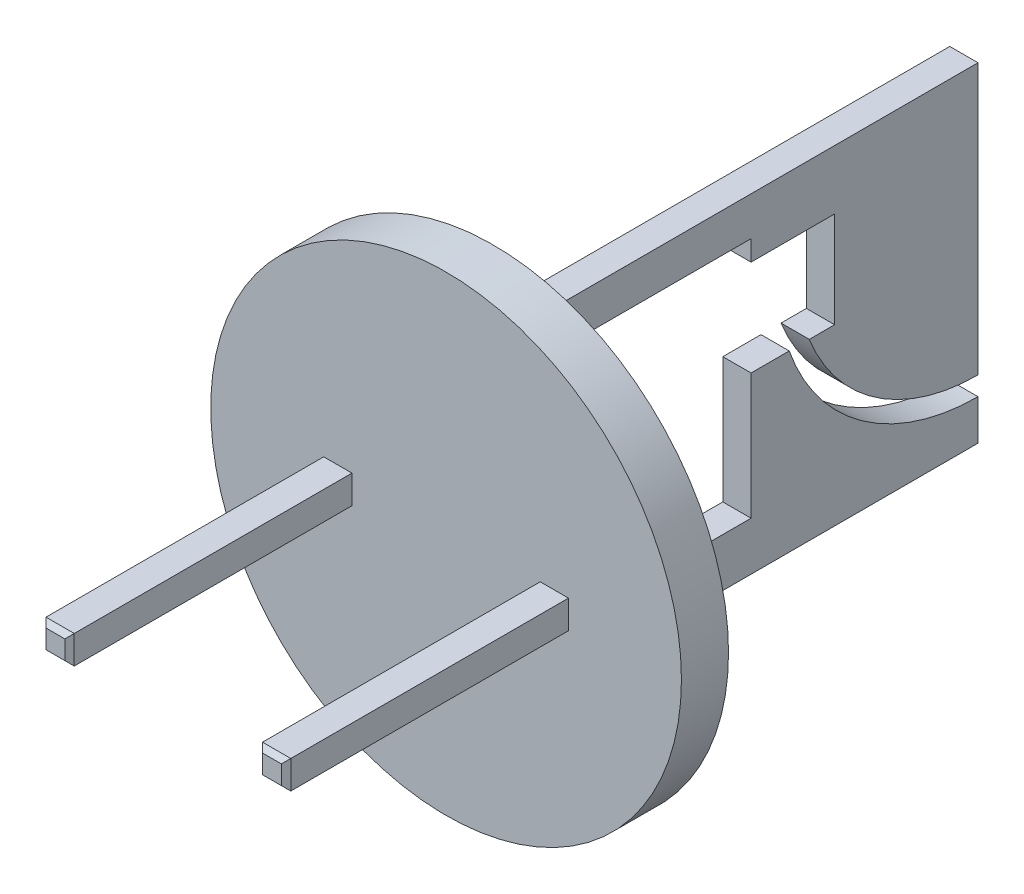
ISO-10303-21;
HEADER;
FILE_DESCRIPTION(('STEP AP214'),'2;1');
FILE_NAME('part.step','',(''),(''),'','','');
FILE_SCHEMA(('AUTOMOTIVE_DESIGN { 1 0 10303 214 1 1 1 1 }'));
ENDSEC;
DATA;
#1=APPLICATION_CONTEXT('core data for automotive mechanical design processes');
#2=APPLICATION_PROTOCOL_DEFINITION('international standard','automotive_design',2000,#1);
#3=PRODUCT_CONTEXT('',#1,'mechanical');
#4=PRODUCT('Part','Part','',(#3));
#5=PRODUCT_RELATED_PRODUCT_CATEGORY('part','',(#4));
#6=PRODUCT_DEFINITION_FORMATION('','',#4);
#7=PRODUCT_DEFINITION_CONTEXT('part definition',#1,'design');
#8=PRODUCT_DEFINITION('design','',#6,#7);
#9=PRODUCT_DEFINITION_SHAPE('','',#8);
#10=(LENGTH_UNIT() NAMED_UNIT(*) SI_UNIT(.MILLI.,.METRE.));
#11=(NAMED_UNIT(*) PLANE_ANGLE_UNIT() SI_UNIT($,.RADIAN.));
#12=(NAMED_UNIT(*) SI_UNIT($,.STERADIAN.) SOLID_ANGLE_UNIT());
#13=UNCERTAINTY_MEASURE_WITH_UNIT(LENGTH_MEASURE(1.E-05),#10,'distance_accuracy_value','');
#14=(GEOMETRIC_REPRESENTATION_CONTEXT(3) GLOBAL_UNCERTAINTY_ASSIGNED_CONTEXT((#13)) GLOBAL_UNIT_ASSIGNED_CONTEXT((#10,
#11,#12)) REPRESENTATION_CONTEXT('',''));
#15=CARTESIAN_POINT('',(0.,0.,0.));
#16=DIRECTION('',(0.,0.,1.));
#17=DIRECTION('',(1.,0.,0.));
#18=AXIS2_PLACEMENT_3D('',#15,#16,#17);
#19=CARTESIAN_POINT('',(0.,0.,0.));
#20=DIRECTION('',(0.,0.,1.));
#21=DIRECTION('',(1.,0.,0.));
#22=AXIS2_PLACEMENT_3D('',#19,#20,#21);
#23=PLANE('',#22);
#24=DIRECTION('',(1.,0.,0.));
#25=VECTOR('',#24,1.);
#26=CARTESIAN_POINT('',(-1.3,-0.15,0.));
#27=LINE('',#26,#25);
#28=CARTESIAN_POINT('',(-1.3,-0.15,0.));
#29=VERTEX_POINT('',#28);
#30=CARTESIAN_POINT('',(-1.,-0.15,0.));
#31=VERTEX_POINT('',#30);
#32=EDGE_CURVE('E253',#29,#31,#27,.T.);
#33=ORIENTED_EDGE('',*,*,#32,.F.);
#34=DIRECTION('',(0.,-1.,0.));
#35=VECTOR('',#34,1.);
#36=CARTESIAN_POINT('',(-1.3,0.15,0.));
#37=LINE('',#36,#35);
#38=CARTESIAN_POINT('',(-1.3,0.15,0.));
#39=VERTEX_POINT('',#38);
#40=EDGE_CURVE('E226',#39,#29,#37,.T.);
#41=ORIENTED_EDGE('',*,*,#40,.F.);
#42=DIRECTION('',(-1.,0.,0.));
#43=VECTOR('',#42,1.);
#44=CARTESIAN_POINT('',(-1.3,0.15,0.));
#45=LINE('',#44,#43);
#46=CARTESIAN_POINT('',(-1.,0.15,0.));
#47=VERTEX_POINT('',#46);
#48=EDGE_CURVE('E259',#47,#39,#45,.T.);
#49=ORIENTED_EDGE('',*,*,#48,.F.);
#50=DIRECTION('',(0.,1.,0.));
#51=VECTOR('',#50,1.);
#52=CARTESIAN_POINT('',(-1.,0.15,0.));
#53=LINE('',#52,#51);
#54=EDGE_CURVE('E256',#31,#47,#53,.T.);
#55=ORIENTED_EDGE('',*,*,#54,.F.);
#56=EDGE_LOOP('',(#33,#41,#49,#55));
#57=FACE_BOUND('',#56,.T.);
#58=CARTESIAN_POINT('',(0.,0.,0.));
#59=DIRECTION('',(0.,0.,1.));
#60=DIRECTION('',(1.,0.,0.));
#61=AXIS2_PLACEMENT_3D('',#58,#59,#60);
#62=CIRCLE('',#61,2.5);
#63=CARTESIAN_POINT('',(2.5,0.,0.));
#64=VERTEX_POINT('',#63);
#65=EDGE_CURVE('E363',#64,#64,#62,.T.);
#66=ORIENTED_EDGE('',*,*,#65,.T.);
#67=EDGE_LOOP('',(#66));
#68=FACE_BOUND('',#67,.T.);
#69=DIRECTION('',(0.,-1.,0.));
#70=VECTOR('',#69,1.);
#71=CARTESIAN_POINT('',(1.,0.15,0.));
#72=LINE('',#71,#70);
#73=CARTESIAN_POINT('',(1.,0.15,0.));
#74=VERTEX_POINT('',#73);
#75=CARTESIAN_POINT('',(1.,-0.15,0.));
#76=VERTEX_POINT('',#75);
#77=EDGE_CURVE('E220',#74,#76,#72,.T.);
#78=ORIENTED_EDGE('',*,*,#77,.F.);
#79=DIRECTION('',(-1.,0.,0.));
#80=VECTOR('',#79,1.);
#81=CARTESIAN_POINT('',(1.3,0.15,0.));
#82=LINE('',#81,#80);
#83=CARTESIAN_POINT('',(1.3,0.15,0.));
#84=VERTEX_POINT('',#83);
#85=EDGE_CURVE('E230',#84,#74,#82,.T.);
#86=ORIENTED_EDGE('',*,*,#85,.F.);
#87=DIRECTION('',(0.,1.,0.));
#88=VECTOR('',#87,1.);
#89=CARTESIAN_POINT('',(1.3,0.15,0.));
#90=LINE('',#89,#88);
#91=CARTESIAN_POINT('',(1.3,-0.15,0.));
#92=VERTEX_POINT('',#91);
#93=EDGE_CURVE('E242',#92,#84,#90,.T.);
#94=ORIENTED_EDGE('',*,*,#93,.F.);
#95=DIRECTION('',(1.,0.,0.));
#96=VECTOR('',#95,1.);
#97=CARTESIAN_POINT('',(1.3,-0.15,0.));
#98=LINE('',#97,#96);
#99=EDGE_CURVE('E240',#76,#92,#98,.T.);
#100=ORIENTED_EDGE('',*,*,#99,.F.);
#101=EDGE_LOOP('',(#78,#86,#94,#100));
#102=FACE_BOUND('',#101,.T.);
#103=ADVANCED_FACE('F31',(#57,#68,#102),#23,.T.);
#104=CARTESIAN_POINT('',(0.15,1.75,-5.5));
#105=DIRECTION('',(-1.,0.,0.));
#106=DIRECTION('',(0.,-1.,0.));
#107=AXIS2_PLACEMENT_3D('',#104,#105,#106);
#108=PLANE('',#107);
#109=DIRECTION('',(0.,-1.,0.));
#110=VECTOR('',#109,1.);
#111=CARTESIAN_POINT('',(0.15,1.75,-5.5));
#112=LINE('',#111,#110);
#113=CARTESIAN_POINT('',(0.15,-1.32192723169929,-5.5));
#114=VERTEX_POINT('',#113);
#115=CARTESIAN_POINT('',(0.15,-1.75,-5.5));
#116=VERTEX_POINT('',#115);
#117=EDGE_CURVE('E339',#114,#116,#112,.T.);
#118=ORIENTED_EDGE('',*,*,#117,.F.);
#119=CARTESIAN_POINT('',(0.15,0.802208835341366,-5.5));
#120=DIRECTION('',(1.,0.,0.));
#121=DIRECTION('',(0.,1.,0.));
#122=AXIS2_PLACEMENT_3D('',#119,#120,#121);
#123=CIRCLE('',#122,2.12413606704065);
#124=CARTESIAN_POINT('',(0.15,0.101539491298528,-3.49475275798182));
#125=VERTEX_POINT('',#124);
#126=EDGE_CURVE('E288',#125,#114,#123,.T.);
#127=ORIENTED_EDGE('',*,*,#126,.F.);
#128=DIRECTION('',(0.,0.,-1.));
#129=VECTOR('',#128,1.);
#130=CARTESIAN_POINT('',(0.15,0.101539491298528,-3.08935742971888));
#131=LINE('',#130,#129);
#132=CARTESIAN_POINT('',(0.15,0.101539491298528,-3.08935742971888));
#133=VERTEX_POINT('',#132);
#134=EDGE_CURVE('E285',#133,#125,#131,.T.);
#135=ORIENTED_EDGE('',*,*,#134,.F.);
#136=DIRECTION('',(0.,1.,0.));
#137=VECTOR('',#136,1.);
#138=CARTESIAN_POINT('',(0.15,0.101539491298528,-3.08935742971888));
#139=LINE('',#138,#137);
#140=CARTESIAN_POINT('',(0.15,-1.23460508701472,-3.08935742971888));
#141=VERTEX_POINT('',#140);
#142=EDGE_CURVE('E282',#141,#133,#139,.T.);
#143=ORIENTED_EDGE('',*,*,#142,.F.);
#144=DIRECTION('',(0.,0.,-1.));
#145=VECTOR('',#144,1.);
#146=CARTESIAN_POINT('',(0.15,-1.23460508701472,-0.5));
#147=LINE('',#146,#145);
#148=CARTESIAN_POINT('',(0.15,-1.23460508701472,-0.5));
#149=VERTEX_POINT('',#148);
#150=EDGE_CURVE('E279',#149,#141,#147,.T.);
#151=ORIENTED_EDGE('',*,*,#150,.F.);
#152=DIRECTION('',(0.,-1.,0.));
#153=VECTOR('',#152,1.);
#154=CARTESIAN_POINT('',(0.15,1.75,-0.5));
#155=LINE('',#154,#153);
#156=CARTESIAN_POINT('',(0.15,-1.75,-0.5));
#157=VERTEX_POINT('',#156);
#158=EDGE_CURVE('E325',#149,#157,#155,.T.);
#159=ORIENTED_EDGE('',*,*,#158,.T.);
#160=DIRECTION('',(0.,0.,1.));
#161=VECTOR('',#160,1.);
#162=CARTESIAN_POINT('',(0.15,-1.75,-5.5));
#163=LINE('',#162,#161);
#164=EDGE_CURVE('E360',#116,#157,#163,.T.);
#165=ORIENTED_EDGE('',*,*,#164,.F.);
#166=EDGE_LOOP('',(#118,#127,#135,#143,#151,#159,#165));
#167=FACE_BOUND('',#166,.T.);
#168=ADVANCED_FACE('F498',(#167),#108,.F.);
#169=CARTESIAN_POINT('',(-0.15,1.75,-5.5));
#170=DIRECTION('',(1.,0.,0.));
#171=DIRECTION('',(0.,1.,0.));
#172=AXIS2_PLACEMENT_3D('',#169,#170,#171);
#173=PLANE('',#172);
#174=DIRECTION('',(0.,0.,-1.));
#175=VECTOR('',#174,1.);
#176=CARTESIAN_POINT('',(-0.15,0.101539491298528,-5.5));
#177=LINE('',#176,#175);
#178=CARTESIAN_POINT('',(-0.15,0.101539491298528,-3.08935742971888));
#179=VERTEX_POINT('',#178);
#180=CARTESIAN_POINT('',(-0.15,0.101539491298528,-3.49475275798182));
#181=VERTEX_POINT('',#180);
#182=EDGE_CURVE('E394',#179,#181,#177,.T.);
#183=ORIENTED_EDGE('',*,*,#182,.T.);
#184=CARTESIAN_POINT('',(-0.15,0.802208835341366,-5.5));
#185=DIRECTION('',(1.,0.,0.));
#186=DIRECTION('',(0.,1.,0.));
#187=AXIS2_PLACEMENT_3D('',#184,#185,#186);
#188=CIRCLE('',#187,2.12413606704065);
#189=CARTESIAN_POINT('',(-0.15,-1.32192723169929,-5.5));
#190=VERTEX_POINT('',#189);
#191=EDGE_CURVE('E302',#181,#190,#188,.T.);
#192=ORIENTED_EDGE('',*,*,#191,.T.);
#193=DIRECTION('',(0.,1.,0.));
#194=VECTOR('',#193,1.);
#195=CARTESIAN_POINT('',(-0.15,1.75,-5.5));
#196=LINE('',#195,#194);
#197=CARTESIAN_POINT('',(-0.15,-1.75,-5.5));
#198=VERTEX_POINT('',#197);
#199=EDGE_CURVE('E346',#198,#190,#196,.T.);
#200=ORIENTED_EDGE('',*,*,#199,.F.);
#201=DIRECTION('',(0.,0.,1.));
#202=VECTOR('',#201,1.);
#203=CARTESIAN_POINT('',(-0.15,-1.75,-5.5));
#204=LINE('',#203,#202);
#205=CARTESIAN_POINT('',(-0.15,-1.75,-0.5));
#206=VERTEX_POINT('',#205);
#207=EDGE_CURVE('E357',#198,#206,#204,.T.);
#208=ORIENTED_EDGE('',*,*,#207,.T.);
#209=DIRECTION('',(0.,1.,0.));
#210=VECTOR('',#209,1.);
#211=CARTESIAN_POINT('',(-0.15,1.75,-0.5));
#212=LINE('',#211,#210);
#213=CARTESIAN_POINT('',(-0.15,-1.23460508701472,-0.5));
#214=VERTEX_POINT('',#213);
#215=EDGE_CURVE('E333',#206,#214,#212,.T.);
#216=ORIENTED_EDGE('',*,*,#215,.T.);
#217=DIRECTION('',(0.,0.,-1.));
#218=VECTOR('',#217,1.);
#219=CARTESIAN_POINT('',(-0.15,-1.23460508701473,-5.5));
#220=LINE('',#219,#218);
#221=CARTESIAN_POINT('',(-0.15,-1.23460508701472,-3.08935742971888));
#222=VERTEX_POINT('',#221);
#223=EDGE_CURVE('E388',#214,#222,#220,.T.);
#224=ORIENTED_EDGE('',*,*,#223,.T.);
#225=DIRECTION('',(0.,1.,0.));
#226=VECTOR('',#225,1.);
#227=CARTESIAN_POINT('',(-0.15,1.75,-3.08935742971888));
#228=LINE('',#227,#226);
#229=EDGE_CURVE('E391',#222,#179,#228,.T.);
#230=ORIENTED_EDGE('',*,*,#229,.T.);
#231=EDGE_LOOP('',(#183,#192,#200,#208,#216,#224,#230));
#232=FACE_BOUND('',#231,.T.);
#233=ADVANCED_FACE('F502',(#232),#173,.F.);
#234=CARTESIAN_POINT('',(0.15,-1.75,-5.5));
#235=DIRECTION('',(0.,0.,-1.));
#236=DIRECTION('',(-1.,0.,0.));
#237=AXIS2_PLACEMENT_3D('',#234,#235,#236);
#238=PLANE('',#237);
#239=DIRECTION('',(1.,0.,0.));
#240=VECTOR('',#239,1.);
#241=CARTESIAN_POINT('',(-2.5,-1.12192723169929,-5.5));
#242=LINE('',#241,#240);
#243=CARTESIAN_POINT('',(-0.15,-1.12192723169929,-5.5));
#244=VERTEX_POINT('',#243);
#245=CARTESIAN_POINT('',(0.15,-1.12192723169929,-5.5));
#246=VERTEX_POINT('',#245);
#247=EDGE_CURVE('E371',#244,#246,#242,.T.);
#248=ORIENTED_EDGE('',*,*,#247,.F.);
#249=CARTESIAN_POINT('',(-0.15,1.75,-5.5));
#250=VERTEX_POINT('',#249);
#251=EDGE_CURVE('E345',#244,#250,#196,.T.);
#252=ORIENTED_EDGE('',*,*,#251,.T.);
#253=DIRECTION('',(1.,0.,0.));
#254=VECTOR('',#253,1.);
#255=CARTESIAN_POINT('',(0.15,1.75,-5.5));
#256=LINE('',#255,#254);
#257=CARTESIAN_POINT('',(0.15,1.75,-5.5));
#258=VERTEX_POINT('',#257);
#259=EDGE_CURVE('E349',#250,#258,#256,.T.);
#260=ORIENTED_EDGE('',*,*,#259,.T.);
#261=EDGE_CURVE('E340',#258,#246,#112,.T.);
#262=ORIENTED_EDGE('',*,*,#261,.T.);
#263=EDGE_LOOP('',(#248,#252,#260,#262));
#264=FACE_BOUND('',#263,.T.);
#265=ADVANCED_FACE('F509',(#264),#238,.T.);
#266=CARTESIAN_POINT('',(0.,0.,-0.5));
#267=DIRECTION('',(0.,0.,1.));
#268=DIRECTION('',(1.,0.,0.));
#269=AXIS2_PLACEMENT_3D('',#266,#267,#268);
#270=PLANE('',#269);
#271=DIRECTION('',(1.,0.,0.));
#272=VECTOR('',#271,1.);
#273=CARTESIAN_POINT('',(-2.5,-1.23460508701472,-0.5));
#274=LINE('',#273,#272);
#275=EDGE_CURVE('E313',#214,#149,#274,.T.);
#276=ORIENTED_EDGE('',*,*,#275,.F.);
#277=ORIENTED_EDGE('',*,*,#215,.F.);
#278=DIRECTION('',(-1.,0.,0.));
#279=VECTOR('',#278,1.);
#280=CARTESIAN_POINT('',(0.15,-1.75,-0.5));
#281=LINE('',#280,#279);
#282=EDGE_CURVE('E329',#157,#206,#281,.T.);
#283=ORIENTED_EDGE('',*,*,#282,.F.);
#284=ORIENTED_EDGE('',*,*,#158,.F.);
#285=EDGE_LOOP('',(#276,#277,#283,#284));
#286=FACE_BOUND('',#285,.T.);
#287=CARTESIAN_POINT('',(0.,0.,-0.5));
#288=DIRECTION('',(0.,0.,1.));
#289=DIRECTION('',(1.,0.,0.));
#290=AXIS2_PLACEMENT_3D('',#287,#288,#289);
#291=CIRCLE('',#290,2.5);
#292=CARTESIAN_POINT('',(2.5,0.,-0.5));
#293=VERTEX_POINT('',#292);
#294=EDGE_CURVE('E366',#293,#293,#291,.F.);
#295=ORIENTED_EDGE('',*,*,#294,.T.);
#296=EDGE_LOOP('',(#295));
#297=FACE_BOUND('',#296,.T.);
#298=CARTESIAN_POINT('',(-0.15,1.33701472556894,-0.5));
#299=VERTEX_POINT('',#298);
#300=CARTESIAN_POINT('',(-0.15,1.75,-0.5));
#301=VERTEX_POINT('',#300);
#302=EDGE_CURVE('E332',#299,#301,#212,.T.);
#303=ORIENTED_EDGE('',*,*,#302,.F.);
#304=DIRECTION('',(1.,0.,0.));
#305=VECTOR('',#304,1.);
#306=CARTESIAN_POINT('',(-2.5,1.33701472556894,-0.5));
#307=LINE('',#306,#305);
#308=CARTESIAN_POINT('',(0.15,1.33701472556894,-0.5));
#309=VERTEX_POINT('',#308);
#310=EDGE_CURVE('E315',#299,#309,#307,.T.);
#311=ORIENTED_EDGE('',*,*,#310,.T.);
#312=CARTESIAN_POINT('',(0.15,1.75,-0.5));
#313=VERTEX_POINT('',#312);
#314=EDGE_CURVE('E326',#313,#309,#155,.T.);
#315=ORIENTED_EDGE('',*,*,#314,.F.);
#316=DIRECTION('',(1.,0.,0.));
#317=VECTOR('',#316,1.);
#318=CARTESIAN_POINT('',(0.15,1.75,-0.5));
#319=LINE('',#318,#317);
#320=EDGE_CURVE('E336',#301,#313,#319,.T.);
#321=ORIENTED_EDGE('',*,*,#320,.F.);
#322=EDGE_LOOP('',(#303,#311,#315,#321));
#323=FACE_BOUND('',#322,.T.);
#324=ADVANCED_FACE('F507',(#286,#297,#323),#270,.F.);
#325=CARTESIAN_POINT('',(0.,0.,-7.57106781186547));
#326=DIRECTION('',(0.,0.,1.));
#327=DIRECTION('',(1.,0.,0.));
#328=AXIS2_PLACEMENT_3D('',#325,#326,#327);
#329=CYLINDRICAL_SURFACE('',#328,2.5);
#330=ORIENTED_EDGE('',*,*,#294,.F.);
#331=EDGE_LOOP('',(#330));
#332=FACE_BOUND('',#331,.T.);
#333=ORIENTED_EDGE('',*,*,#65,.F.);
#334=EDGE_LOOP('',(#333));
#335=FACE_BOUND('',#334,.T.);
#336=ADVANCED_FACE('F33',(#332,#335),#329,.T.);
#337=DIRECTION('',(0.,0.,-1.));
#338=VECTOR('',#337,1.);
#339=CARTESIAN_POINT('',(0.15,0.101539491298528,-3.70797263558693));
#340=LINE('',#339,#338);
#341=CARTESIAN_POINT('',(0.15,0.101539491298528,-3.70797263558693));
#342=VERTEX_POINT('',#341);
#343=CARTESIAN_POINT('',(0.15,0.101539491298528,-3.97690763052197));
#344=VERTEX_POINT('',#343);
#345=EDGE_CURVE('E293',#342,#344,#340,.T.);
#346=ORIENTED_EDGE('',*,*,#345,.F.);
#347=CARTESIAN_POINT('',(0.15,0.802208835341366,-5.5));
#348=DIRECTION('',(-1.,0.,0.));
#349=DIRECTION('',(0.,1.,0.));
#350=AXIS2_PLACEMENT_3D('',#347,#348,#349);
#351=CIRCLE('',#350,1.92413606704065);
#352=EDGE_CURVE('E290',#246,#342,#351,.T.);
#353=ORIENTED_EDGE('',*,*,#352,.F.);
#354=ORIENTED_EDGE('',*,*,#261,.F.);
#355=DIRECTION('',(0.,0.,1.));
#356=VECTOR('',#355,1.);
#357=CARTESIAN_POINT('',(0.15,1.75,-5.5));
#358=LINE('',#357,#356);
#359=EDGE_CURVE('E351',#258,#313,#358,.T.);
#360=ORIENTED_EDGE('',*,*,#359,.T.);
#361=ORIENTED_EDGE('',*,*,#314,.T.);
#362=DIRECTION('',(0.,0.,1.));
#363=VECTOR('',#362,1.);
#364=CARTESIAN_POINT('',(0.15,1.33701472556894,-0.5));
#365=LINE('',#364,#363);
#366=CARTESIAN_POINT('',(0.15,1.33701472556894,-3.08935742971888));
#367=VERTEX_POINT('',#366);
#368=EDGE_CURVE('E276',#367,#309,#365,.T.);
#369=ORIENTED_EDGE('',*,*,#368,.F.);
#370=DIRECTION('',(0.,1.,0.));
#371=VECTOR('',#370,1.);
#372=CARTESIAN_POINT('',(0.15,1.33701472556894,-3.08935742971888));
#373=LINE('',#372,#371);
#374=CARTESIAN_POINT('',(0.15,1.12081659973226,-3.08935742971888));
#375=VERTEX_POINT('',#374);
#376=EDGE_CURVE('E273',#375,#367,#373,.T.);
#377=ORIENTED_EDGE('',*,*,#376,.F.);
#378=DIRECTION('',(0.,0.,1.));
#379=VECTOR('',#378,1.);
#380=CARTESIAN_POINT('',(0.15,1.12081659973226,-3.08935742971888));
#381=LINE('',#380,#379);
#382=CARTESIAN_POINT('',(0.15,1.12081659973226,-3.97690763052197));
#383=VERTEX_POINT('',#382);
#384=EDGE_CURVE('E270',#383,#375,#381,.T.);
#385=ORIENTED_EDGE('',*,*,#384,.F.);
#386=DIRECTION('',(0.,1.,0.));
#387=VECTOR('',#386,1.);
#388=CARTESIAN_POINT('',(0.15,1.12081659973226,-3.97690763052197));
#389=LINE('',#388,#387);
#390=EDGE_CURVE('E296',#344,#383,#389,.T.);
#391=ORIENTED_EDGE('',*,*,#390,.F.);
#392=EDGE_LOOP('',(#346,#353,#354,#360,#361,#369,#377,#385,#391));
#393=FACE_BOUND('',#392,.T.);
#394=ADVANCED_FACE('F505',(#393),#108,.F.);
#395=CARTESIAN_POINT('',(0.15,-1.75,-5.5));
#396=DIRECTION('',(0.,1.,0.));
#397=DIRECTION('',(0.,0.,1.));
#398=AXIS2_PLACEMENT_3D('',#395,#396,#397);
#399=PLANE('',#398);
#400=ORIENTED_EDGE('',*,*,#282,.T.);
#401=ORIENTED_EDGE('',*,*,#207,.F.);
#402=DIRECTION('',(-1.,0.,0.));
#403=VECTOR('',#402,1.);
#404=CARTESIAN_POINT('',(0.15,-1.75,-5.5));
#405=LINE('',#404,#403);
#406=EDGE_CURVE('E343',#116,#198,#405,.T.);
#407=ORIENTED_EDGE('',*,*,#406,.F.);
#408=ORIENTED_EDGE('',*,*,#164,.T.);
#409=EDGE_LOOP('',(#400,#401,#407,#408));
#410=FACE_BOUND('',#409,.T.);
#411=ADVANCED_FACE('F513',(#410),#399,.F.);
#412=ORIENTED_EDGE('',*,*,#251,.F.);
#413=CARTESIAN_POINT('',(-0.15,0.802208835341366,-5.5));
#414=DIRECTION('',(1.,0.,0.));
#415=DIRECTION('',(0.,1.,0.));
#416=AXIS2_PLACEMENT_3D('',#413,#414,#415);
#417=CIRCLE('',#416,1.92413606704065);
#418=CARTESIAN_POINT('',(-0.15,0.101539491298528,-3.70797263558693));
#419=VERTEX_POINT('',#418);
#420=EDGE_CURVE('E322',#244,#419,#417,.F.);
#421=ORIENTED_EDGE('',*,*,#420,.T.);
#422=DIRECTION('',(0.,0.,-1.));
#423=VECTOR('',#422,1.);
#424=CARTESIAN_POINT('',(-0.15,0.101539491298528,-5.5));
#425=LINE('',#424,#423);
#426=CARTESIAN_POINT('',(-0.15,0.101539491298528,-3.97690763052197));
#427=VERTEX_POINT('',#426);
#428=EDGE_CURVE('E385',#419,#427,#425,.T.);
#429=ORIENTED_EDGE('',*,*,#428,.T.);
#430=DIRECTION('',(0.,1.,0.));
#431=VECTOR('',#430,1.);
#432=CARTESIAN_POINT('',(-0.15,1.75,-3.97690763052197));
#433=LINE('',#432,#431);
#434=CARTESIAN_POINT('',(-0.15,1.12081659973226,-3.97690763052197));
#435=VERTEX_POINT('',#434);
#436=EDGE_CURVE('E382',#427,#435,#433,.T.);
#437=ORIENTED_EDGE('',*,*,#436,.T.);
#438=DIRECTION('',(0.,0.,1.));
#439=VECTOR('',#438,1.);
#440=CARTESIAN_POINT('',(-0.15,1.12081659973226,-5.5));
#441=LINE('',#440,#439);
#442=CARTESIAN_POINT('',(-0.15,1.12081659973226,-3.08935742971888));
#443=VERTEX_POINT('',#442);
#444=EDGE_CURVE('E379',#435,#443,#441,.T.);
#445=ORIENTED_EDGE('',*,*,#444,.T.);
#446=DIRECTION('',(0.,1.,0.));
#447=VECTOR('',#446,1.);
#448=CARTESIAN_POINT('',(-0.15,1.75,-3.08935742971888));
#449=LINE('',#448,#447);
#450=CARTESIAN_POINT('',(-0.15,1.33701472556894,-3.08935742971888));
#451=VERTEX_POINT('',#450);
#452=EDGE_CURVE('E373',#443,#451,#449,.T.);
#453=ORIENTED_EDGE('',*,*,#452,.T.);
#454=DIRECTION('',(0.,0.,1.));
#455=VECTOR('',#454,1.);
#456=CARTESIAN_POINT('',(-0.15,1.33701472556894,-5.5));
#457=LINE('',#456,#455);
#458=EDGE_CURVE('E376',#451,#299,#457,.T.);
#459=ORIENTED_EDGE('',*,*,#458,.T.);
#460=ORIENTED_EDGE('',*,*,#302,.T.);
#461=DIRECTION('',(0.,0.,1.));
#462=VECTOR('',#461,1.);
#463=CARTESIAN_POINT('',(-0.15,1.75,-5.5));
#464=LINE('',#463,#462);
#465=EDGE_CURVE('E354',#250,#301,#464,.T.);
#466=ORIENTED_EDGE('',*,*,#465,.F.);
#467=EDGE_LOOP('',(#412,#421,#429,#437,#445,#453,#459,#460,#466));
#468=FACE_BOUND('',#467,.T.);
#469=ADVANCED_FACE('F517',(#468),#173,.F.);
#470=CARTESIAN_POINT('',(0.15,1.75,-5.5));
#471=DIRECTION('',(0.,-1.,0.));
#472=DIRECTION('',(0.,0.,-1.));
#473=AXIS2_PLACEMENT_3D('',#470,#471,#472);
#474=PLANE('',#473);
#475=ORIENTED_EDGE('',*,*,#320,.T.);
#476=ORIENTED_EDGE('',*,*,#359,.F.);
#477=ORIENTED_EDGE('',*,*,#259,.F.);
#478=ORIENTED_EDGE('',*,*,#465,.T.);
#479=EDGE_LOOP('',(#475,#476,#477,#478));
#480=FACE_BOUND('',#479,.T.);
#481=ADVANCED_FACE('F521',(#480),#474,.F.);
#482=DIRECTION('',(1.,0.,0.));
#483=VECTOR('',#482,1.);
#484=CARTESIAN_POINT('',(-2.5,-1.32192723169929,-5.5));
#485=LINE('',#484,#483);
#486=EDGE_CURVE('E369',#114,#190,#485,.F.);
#487=ORIENTED_EDGE('',*,*,#486,.F.);
#488=ORIENTED_EDGE('',*,*,#117,.T.);
#489=ORIENTED_EDGE('',*,*,#406,.T.);
#490=ORIENTED_EDGE('',*,*,#199,.T.);
#491=EDGE_LOOP('',(#487,#488,#489,#490));
#492=FACE_BOUND('',#491,.T.);
#493=ADVANCED_FACE('F525',(#492),#238,.T.);
#494=CARTESIAN_POINT('',(-2.5,1.12081659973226,-3.08935742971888));
#495=DIRECTION('',(0.,1.,0.));
#496=DIRECTION('',(-1.,0.,0.));
#497=AXIS2_PLACEMENT_3D('',#494,#495,#496);
#498=PLANE('',#497);
#499=DIRECTION('',(1.,0.,0.));
#500=VECTOR('',#499,1.);
#501=CARTESIAN_POINT('',(-2.5,1.12081659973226,-3.97690763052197));
#502=LINE('',#501,#500);
#503=EDGE_CURVE('E300',#435,#383,#502,.T.);
#504=ORIENTED_EDGE('',*,*,#503,.T.);
#505=ORIENTED_EDGE('',*,*,#384,.T.);
#506=DIRECTION('',(1.,0.,0.));
#507=VECTOR('',#506,1.);
#508=CARTESIAN_POINT('',(-2.5,1.12081659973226,-3.08935742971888));
#509=LINE('',#508,#507);
#510=EDGE_CURVE('E299',#443,#375,#509,.T.);
#511=ORIENTED_EDGE('',*,*,#510,.F.);
#512=ORIENTED_EDGE('',*,*,#444,.F.);
#513=EDGE_LOOP('',(#504,#505,#511,#512));
#514=FACE_BOUND('',#513,.T.);
#515=ADVANCED_FACE('F529',(#514),#498,.F.);
#516=CARTESIAN_POINT('',(-2.5,1.12081659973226,-3.97690763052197));
#517=DIRECTION('',(0.,0.,-1.));
#518=DIRECTION('',(-1.,0.,0.));
#519=AXIS2_PLACEMENT_3D('',#516,#517,#518);
#520=PLANE('',#519);
#521=DIRECTION('',(1.,0.,0.));
#522=VECTOR('',#521,1.);
#523=CARTESIAN_POINT('',(-2.5,0.101539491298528,-3.97690763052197));
#524=LINE('',#523,#522);
#525=EDGE_CURVE('E303',#427,#344,#524,.T.);
#526=ORIENTED_EDGE('',*,*,#525,.T.);
#527=ORIENTED_EDGE('',*,*,#390,.T.);
#528=ORIENTED_EDGE('',*,*,#503,.F.);
#529=ORIENTED_EDGE('',*,*,#436,.F.);
#530=EDGE_LOOP('',(#526,#527,#528,#529));
#531=FACE_BOUND('',#530,.T.);
#532=ADVANCED_FACE('F533',(#531),#520,.F.);
#533=CARTESIAN_POINT('',(-2.5,0.101539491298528,-3.70797263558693));
#534=DIRECTION('',(0.,-1.,0.));
#535=DIRECTION('',(1.,0.,0.));
#536=AXIS2_PLACEMENT_3D('',#533,#534,#535);
#537=PLANE('',#536);
#538=DIRECTION('',(1.,0.,0.));
#539=VECTOR('',#538,1.);
#540=CARTESIAN_POINT('',(-2.5,0.101539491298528,-3.70797263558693));
#541=LINE('',#540,#539);
#542=EDGE_CURVE('E305',#419,#342,#541,.T.);
#543=ORIENTED_EDGE('',*,*,#542,.T.);
#544=ORIENTED_EDGE('',*,*,#345,.T.);
#545=ORIENTED_EDGE('',*,*,#525,.F.);
#546=ORIENTED_EDGE('',*,*,#428,.F.);
#547=EDGE_LOOP('',(#543,#544,#545,#546));
#548=FACE_BOUND('',#547,.T.);
#549=ADVANCED_FACE('F555',(#548),#537,.F.);
#550=CARTESIAN_POINT('',(-2.5,0.101539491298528,-3.08935742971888));
#551=DIRECTION('',(0.,-1.,0.));
#552=DIRECTION('',(1.,0.,0.));
#553=AXIS2_PLACEMENT_3D('',#550,#551,#552);
#554=PLANE('',#553);
#555=DIRECTION('',(1.,0.,0.));
#556=VECTOR('',#555,1.);
#557=CARTESIAN_POINT('',(-2.5,0.101539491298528,-3.08935742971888));
#558=LINE('',#557,#556);
#559=EDGE_CURVE('E309',#179,#133,#558,.T.);
#560=ORIENTED_EDGE('',*,*,#559,.T.);
#561=ORIENTED_EDGE('',*,*,#134,.T.);
#562=DIRECTION('',(1.,0.,0.));
#563=VECTOR('',#562,1.);
#564=CARTESIAN_POINT('',(-2.5,0.101539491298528,-3.49475275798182));
#565=LINE('',#564,#563);
#566=EDGE_CURVE('E307',#181,#125,#565,.T.);
#567=ORIENTED_EDGE('',*,*,#566,.F.);
#568=ORIENTED_EDGE('',*,*,#182,.F.);
#569=EDGE_LOOP('',(#560,#561,#567,#568));
#570=FACE_BOUND('',#569,.T.);
#571=ADVANCED_FACE('F551',(#570),#554,.F.);
#572=CARTESIAN_POINT('',(-2.5,0.101539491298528,-3.08935742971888));
#573=DIRECTION('',(0.,0.,-1.));
#574=DIRECTION('',(0.,1.,0.));
#575=AXIS2_PLACEMENT_3D('',#572,#573,#574);
#576=PLANE('',#575);
#577=DIRECTION('',(1.,0.,0.));
#578=VECTOR('',#577,1.);
#579=CARTESIAN_POINT('',(-2.5,-1.23460508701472,-3.08935742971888));
#580=LINE('',#579,#578);
#581=EDGE_CURVE('E311',#222,#141,#580,.T.);
#582=ORIENTED_EDGE('',*,*,#581,.T.);
#583=ORIENTED_EDGE('',*,*,#142,.T.);
#584=ORIENTED_EDGE('',*,*,#559,.F.);
#585=ORIENTED_EDGE('',*,*,#229,.F.);
#586=EDGE_LOOP('',(#582,#583,#584,#585));
#587=FACE_BOUND('',#586,.T.);
#588=ADVANCED_FACE('F547',(#587),#576,.F.);
#589=CARTESIAN_POINT('',(-2.5,-1.23460508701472,-0.5));
#590=DIRECTION('',(0.,-1.,0.));
#591=DIRECTION('',(1.,0.,0.));
#592=AXIS2_PLACEMENT_3D('',#589,#590,#591);
#593=PLANE('',#592);
#594=ORIENTED_EDGE('',*,*,#275,.T.);
#595=ORIENTED_EDGE('',*,*,#150,.T.);
#596=ORIENTED_EDGE('',*,*,#581,.F.);
#597=ORIENTED_EDGE('',*,*,#223,.F.);
#598=EDGE_LOOP('',(#594,#595,#596,#597));
#599=FACE_BOUND('',#598,.T.);
#600=ADVANCED_FACE('F543',(#599),#593,.F.);
#601=CARTESIAN_POINT('',(-2.5,1.33701472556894,-0.5));
#602=DIRECTION('',(0.,1.,0.));
#603=DIRECTION('',(-1.,0.,0.));
#604=AXIS2_PLACEMENT_3D('',#601,#602,#603);
#605=PLANE('',#604);
#606=DIRECTION('',(1.,0.,0.));
#607=VECTOR('',#606,1.);
#608=CARTESIAN_POINT('',(-2.5,1.33701472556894,-3.08935742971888));
#609=LINE('',#608,#607);
#610=EDGE_CURVE('E317',#451,#367,#609,.T.);
#611=ORIENTED_EDGE('',*,*,#610,.T.);
#612=ORIENTED_EDGE('',*,*,#368,.T.);
#613=ORIENTED_EDGE('',*,*,#310,.F.);
#614=ORIENTED_EDGE('',*,*,#458,.F.);
#615=EDGE_LOOP('',(#611,#612,#613,#614));
#616=FACE_BOUND('',#615,.T.);
#617=ADVANCED_FACE('F539',(#616),#605,.F.);
#618=CARTESIAN_POINT('',(-2.5,1.33701472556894,-3.08935742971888));
#619=DIRECTION('',(0.,0.,-1.));
#620=DIRECTION('',(-1.,0.,0.));
#621=AXIS2_PLACEMENT_3D('',#618,#619,#620);
#622=PLANE('',#621);
#623=ORIENTED_EDGE('',*,*,#510,.T.);
#624=ORIENTED_EDGE('',*,*,#376,.T.);
#625=ORIENTED_EDGE('',*,*,#610,.F.);
#626=ORIENTED_EDGE('',*,*,#452,.F.);
#627=EDGE_LOOP('',(#623,#624,#625,#626));
#628=FACE_BOUND('',#627,.T.);
#629=ADVANCED_FACE('F535',(#628),#622,.F.);
#630=CARTESIAN_POINT('',(-2.5,0.802208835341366,-5.5));
#631=DIRECTION('',(1.,0.,0.));
#632=DIRECTION('',(0.,1.,0.));
#633=AXIS2_PLACEMENT_3D('',#630,#631,#632);
#634=CYLINDRICAL_SURFACE('',#633,1.92413606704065);
#635=ORIENTED_EDGE('',*,*,#247,.T.);
#636=ORIENTED_EDGE('',*,*,#352,.T.);
#637=ORIENTED_EDGE('',*,*,#542,.F.);
#638=ORIENTED_EDGE('',*,*,#420,.F.);
#639=EDGE_LOOP('',(#635,#636,#637,#638));
#640=FACE_BOUND('',#639,.T.);
#641=ADVANCED_FACE('F538',(#640),#634,.T.);
#642=CARTESIAN_POINT('',(-2.5,0.802208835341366,-5.5));
#643=DIRECTION('',(1.,0.,0.));
#644=DIRECTION('',(0.,1.,0.));
#645=AXIS2_PLACEMENT_3D('',#642,#643,#644);
#646=CYLINDRICAL_SURFACE('',#645,2.12413606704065);
#647=ORIENTED_EDGE('',*,*,#566,.T.);
#648=ORIENTED_EDGE('',*,*,#126,.T.);
#649=ORIENTED_EDGE('',*,*,#486,.T.);
#650=ORIENTED_EDGE('',*,*,#191,.F.);
#651=EDGE_LOOP('',(#647,#648,#649,#650));
#652=FACE_BOUND('',#651,.T.);
#653=ADVANCED_FACE('F557',(#652),#646,.F.);
#654=CARTESIAN_POINT('',(-1.3,0.15,3.));
#655=DIRECTION('',(1.,0.,0.));
#656=DIRECTION('',(0.,0.,-1.));
#657=AXIS2_PLACEMENT_3D('',#654,#655,#656);
#658=PLANE('',#657);
#659=DIRECTION('',(0.,0.,-1.));
#660=VECTOR('',#659,1.);
#661=CARTESIAN_POINT('',(-1.3,-0.15,3.));
#662=LINE('',#661,#660);
#663=CARTESIAN_POINT('',(-1.3,-0.15,2.95));
#664=VERTEX_POINT('',#663);
#665=EDGE_CURVE('E268',#664,#29,#662,.T.);
#666=ORIENTED_EDGE('',*,*,#665,.F.);
#667=DIRECTION('',(0.,1.,0.));
#668=VECTOR('',#667,1.);
#669=CARTESIAN_POINT('',(-1.3,0.15,2.95));
#670=LINE('',#669,#668);
#671=CARTESIAN_POINT('',(-1.3,0.15,2.95));
#672=VERTEX_POINT('',#671);
#673=EDGE_CURVE('E39',#664,#672,#670,.T.);
#674=ORIENTED_EDGE('',*,*,#673,.T.);
#675=DIRECTION('',(0.,0.,-1.));
#676=VECTOR('',#675,1.);
#677=CARTESIAN_POINT('',(-1.3,0.15,3.));
#678=LINE('',#677,#676);
#679=EDGE_CURVE('E262',#672,#39,#678,.T.);
#680=ORIENTED_EDGE('',*,*,#679,.T.);
#681=ORIENTED_EDGE('',*,*,#40,.T.);
#682=EDGE_LOOP('',(#666,#674,#680,#681));
#683=FACE_BOUND('',#682,.T.);
#684=ADVANCED_FACE('F560',(#683),#658,.F.);
#685=CARTESIAN_POINT('',(-1.3,-0.15,3.));
#686=DIRECTION('',(0.,1.,0.));
#687=DIRECTION('',(0.,0.,1.));
#688=AXIS2_PLACEMENT_3D('',#685,#686,#687);
#689=PLANE('',#688);
#690=DIRECTION('',(0.,0.,-1.));
#691=VECTOR('',#690,1.);
#692=CARTESIAN_POINT('',(-1.,-0.15,3.));
#693=LINE('',#692,#691);
#694=CARTESIAN_POINT('',(-1.,-0.15,2.95));
#695=VERTEX_POINT('',#694);
#696=EDGE_CURVE('E266',#695,#31,#693,.T.);
#697=ORIENTED_EDGE('',*,*,#696,.F.);
#698=DIRECTION('',(-1.,0.,0.));
#699=VECTOR('',#698,1.);
#700=CARTESIAN_POINT('',(-1.3,-0.15,2.95));
#701=LINE('',#700,#699);
#702=EDGE_CURVE('E53',#695,#664,#701,.T.);
#703=ORIENTED_EDGE('',*,*,#702,.T.);
#704=ORIENTED_EDGE('',*,*,#665,.T.);
#705=ORIENTED_EDGE('',*,*,#32,.T.);
#706=EDGE_LOOP('',(#697,#703,#704,#705));
#707=FACE_BOUND('',#706,.T.);
#708=ADVANCED_FACE('F432',(#707),#689,.F.);
#709=CARTESIAN_POINT('',(-1.,0.15,3.));
#710=DIRECTION('',(-1.,0.,0.));
#711=DIRECTION('',(0.,0.,1.));
#712=AXIS2_PLACEMENT_3D('',#709,#710,#711);
#713=PLANE('',#712);
#714=DIRECTION('',(0.,0.,-1.));
#715=VECTOR('',#714,1.);
#716=CARTESIAN_POINT('',(-1.,0.15,3.));
#717=LINE('',#716,#715);
#718=CARTESIAN_POINT('',(-1.,0.15,2.95));
#719=VERTEX_POINT('',#718);
#720=EDGE_CURVE('E264',#719,#47,#717,.T.);
#721=ORIENTED_EDGE('',*,*,#720,.F.);
#722=DIRECTION('',(0.,-1.,0.));
#723=VECTOR('',#722,1.);
#724=CARTESIAN_POINT('',(-1.,-0.15,2.95));
#725=LINE('',#724,#723);
#726=EDGE_CURVE('E423',#719,#695,#725,.T.);
#727=ORIENTED_EDGE('',*,*,#726,.T.);
#728=ORIENTED_EDGE('',*,*,#696,.T.);
#729=ORIENTED_EDGE('',*,*,#54,.T.);
#730=EDGE_LOOP('',(#721,#727,#728,#729));
#731=FACE_BOUND('',#730,.T.);
#732=ADVANCED_FACE('F429',(#731),#713,.F.);
#733=CARTESIAN_POINT('',(-1.3,0.15,3.));
#734=DIRECTION('',(0.,-1.,0.));
#735=DIRECTION('',(0.,0.,-1.));
#736=AXIS2_PLACEMENT_3D('',#733,#734,#735);
#737=PLANE('',#736);
#738=ORIENTED_EDGE('',*,*,#679,.F.);
#739=DIRECTION('',(1.,0.,0.));
#740=VECTOR('',#739,1.);
#741=CARTESIAN_POINT('',(-1.,0.15,2.95));
#742=LINE('',#741,#740);
#743=EDGE_CURVE('E11',#672,#719,#742,.T.);
#744=ORIENTED_EDGE('',*,*,#743,.T.);
#745=ORIENTED_EDGE('',*,*,#720,.T.);
#746=ORIENTED_EDGE('',*,*,#48,.T.);
#747=EDGE_LOOP('',(#738,#744,#745,#746));
#748=FACE_BOUND('',#747,.T.);
#749=ADVANCED_FACE('F440',(#748),#737,.F.);
#750=CARTESIAN_POINT('',(-1.3,-0.15,3.));
#751=DIRECTION('',(0.,0.,1.));
#752=DIRECTION('',(1.,0.,0.));
#753=AXIS2_PLACEMENT_3D('',#750,#751,#752);
#754=PLANE('',#753);
#755=DIRECTION('',(1.,0.,0.));
#756=VECTOR('',#755,1.);
#757=CARTESIAN_POINT('',(-1.,-0.0999999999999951,3.));
#758=LINE('',#757,#756);
#759=CARTESIAN_POINT('',(-1.25,-0.0999999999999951,3.));
#760=VERTEX_POINT('',#759);
#761=CARTESIAN_POINT('',(-1.05,-0.0999999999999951,3.));
#762=VERTEX_POINT('',#761);
#763=EDGE_CURVE('E418',#760,#762,#758,.T.);
#764=ORIENTED_EDGE('',*,*,#763,.T.);
#765=DIRECTION('',(0.,1.,0.));
#766=VECTOR('',#765,1.);
#767=CARTESIAN_POINT('',(-1.05,0.15,3.));
#768=LINE('',#767,#766);
#769=CARTESIAN_POINT('',(-1.05,0.0999999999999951,3.));
#770=VERTEX_POINT('',#769);
#771=EDGE_CURVE('E420',#762,#770,#768,.T.);
#772=ORIENTED_EDGE('',*,*,#771,.T.);
#773=DIRECTION('',(-1.,0.,0.));
#774=VECTOR('',#773,1.);
#775=CARTESIAN_POINT('',(-1.3,0.0999999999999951,3.));
#776=LINE('',#775,#774);
#777=CARTESIAN_POINT('',(-1.25,0.0999999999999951,3.));
#778=VERTEX_POINT('',#777);
#779=EDGE_CURVE('E414',#770,#778,#776,.T.);
#780=ORIENTED_EDGE('',*,*,#779,.T.);
#781=DIRECTION('',(0.,-1.,0.));
#782=VECTOR('',#781,1.);
#783=CARTESIAN_POINT('',(-1.25,-0.15,3.));
#784=LINE('',#783,#782);
#785=EDGE_CURVE('E416',#778,#760,#784,.T.);
#786=ORIENTED_EDGE('',*,*,#785,.T.);
#787=EDGE_LOOP('',(#764,#772,#780,#786));
#788=FACE_BOUND('',#787,.T.);
#789=ADVANCED_FACE('F579',(#788),#754,.T.);
#790=CARTESIAN_POINT('',(1.3,0.15,3.));
#791=DIRECTION('',(0.,-1.,0.));
#792=DIRECTION('',(1.,0.,0.));
#793=AXIS2_PLACEMENT_3D('',#790,#791,#792);
#794=PLANE('',#793);
#795=DIRECTION('',(0.,0.,-1.));
#796=VECTOR('',#795,1.);
#797=CARTESIAN_POINT('',(1.,0.15,3.));
#798=LINE('',#797,#796);
#799=CARTESIAN_POINT('',(1.,0.15,2.95));
#800=VERTEX_POINT('',#799);
#801=EDGE_CURVE('E215',#800,#74,#798,.T.);
#802=ORIENTED_EDGE('',*,*,#801,.F.);
#803=DIRECTION('',(1.,0.,0.));
#804=VECTOR('',#803,1.);
#805=CARTESIAN_POINT('',(1.3,0.15,2.95));
#806=LINE('',#805,#804);
#807=CARTESIAN_POINT('',(1.3,0.15,2.95));
#808=VERTEX_POINT('',#807);
#809=EDGE_CURVE('E412',#800,#808,#806,.T.);
#810=ORIENTED_EDGE('',*,*,#809,.T.);
#811=DIRECTION('',(0.,0.,-1.));
#812=VECTOR('',#811,1.);
#813=CARTESIAN_POINT('',(1.3,0.15,3.));
#814=LINE('',#813,#812);
#815=EDGE_CURVE('E233',#808,#84,#814,.T.);
#816=ORIENTED_EDGE('',*,*,#815,.T.);
#817=ORIENTED_EDGE('',*,*,#85,.T.);
#818=EDGE_LOOP('',(#802,#810,#816,#817));
#819=FACE_BOUND('',#818,.T.);
#820=ADVANCED_FACE('F231',(#819),#794,.F.);
#821=CARTESIAN_POINT('',(1.,0.15,3.));
#822=DIRECTION('',(1.,0.,0.));
#823=DIRECTION('',(0.,1.,0.));
#824=AXIS2_PLACEMENT_3D('',#821,#822,#823);
#825=PLANE('',#824);
#826=DIRECTION('',(0.,0.,-1.));
#827=VECTOR('',#826,1.);
#828=CARTESIAN_POINT('',(1.,-0.15,3.));
#829=LINE('',#828,#827);
#830=CARTESIAN_POINT('',(1.,-0.15,2.95));
#831=VERTEX_POINT('',#830);
#832=EDGE_CURVE('E227',#831,#76,#829,.T.);
#833=ORIENTED_EDGE('',*,*,#832,.F.);
#834=DIRECTION('',(0.,1.,0.));
#835=VECTOR('',#834,1.);
#836=CARTESIAN_POINT('',(1.,0.15,2.95));
#837=LINE('',#836,#835);
#838=EDGE_CURVE('E223',#831,#800,#837,.T.);
#839=ORIENTED_EDGE('',*,*,#838,.T.);
#840=ORIENTED_EDGE('',*,*,#801,.T.);
#841=ORIENTED_EDGE('',*,*,#77,.T.);
#842=EDGE_LOOP('',(#833,#839,#840,#841));
#843=FACE_BOUND('',#842,.T.);
#844=ADVANCED_FACE('F218',(#843),#825,.F.);
#845=CARTESIAN_POINT('',(1.3,-0.15,3.));
#846=DIRECTION('',(0.,1.,0.));
#847=DIRECTION('',(-1.,0.,0.));
#848=AXIS2_PLACEMENT_3D('',#845,#846,#847);
#849=PLANE('',#848);
#850=DIRECTION('',(0.,0.,-1.));
#851=VECTOR('',#850,1.);
#852=CARTESIAN_POINT('',(1.3,-0.15,3.));
#853=LINE('',#852,#851);
#854=CARTESIAN_POINT('',(1.3,-0.15,2.95));
#855=VERTEX_POINT('',#854);
#856=EDGE_CURVE('E248',#855,#92,#853,.T.);
#857=ORIENTED_EDGE('',*,*,#856,.F.);
#858=DIRECTION('',(-1.,0.,0.));
#859=VECTOR('',#858,1.);
#860=CARTESIAN_POINT('',(1.,-0.15,2.95));
#861=LINE('',#860,#859);
#862=EDGE_CURVE('E409',#855,#831,#861,.T.);
#863=ORIENTED_EDGE('',*,*,#862,.T.);
#864=ORIENTED_EDGE('',*,*,#832,.T.);
#865=ORIENTED_EDGE('',*,*,#99,.T.);
#866=EDGE_LOOP('',(#857,#863,#864,#865));
#867=FACE_BOUND('',#866,.T.);
#868=ADVANCED_FACE('F495',(#867),#849,.F.);
#869=CARTESIAN_POINT('',(1.3,0.15,3.));
#870=DIRECTION('',(-1.,0.,0.));
#871=DIRECTION('',(0.,-1.,0.));
#872=AXIS2_PLACEMENT_3D('',#869,#870,#871);
#873=PLANE('',#872);
#874=ORIENTED_EDGE('',*,*,#815,.F.);
#875=DIRECTION('',(0.,-1.,0.));
#876=VECTOR('',#875,1.);
#877=CARTESIAN_POINT('',(1.3,-0.15,2.95));
#878=LINE('',#877,#876);
#879=EDGE_CURVE('E406',#808,#855,#878,.T.);
#880=ORIENTED_EDGE('',*,*,#879,.T.);
#881=ORIENTED_EDGE('',*,*,#856,.T.);
#882=ORIENTED_EDGE('',*,*,#93,.T.);
#883=EDGE_LOOP('',(#874,#880,#881,#882));
#884=FACE_BOUND('',#883,.T.);
#885=ADVANCED_FACE('F481',(#884),#873,.F.);
#886=CARTESIAN_POINT('',(1.,0.15,3.));
#887=DIRECTION('',(0.,0.,1.));
#888=DIRECTION('',(1.,0.,0.));
#889=AXIS2_PLACEMENT_3D('',#886,#887,#888);
#890=PLANE('',#889);
#891=DIRECTION('',(1.,0.,0.));
#892=VECTOR('',#891,1.);
#893=CARTESIAN_POINT('',(1.3,-0.0999999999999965,3.));
#894=LINE('',#893,#892);
#895=CARTESIAN_POINT('',(1.05,-0.0999999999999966,3.));
#896=VERTEX_POINT('',#895);
#897=CARTESIAN_POINT('',(1.25,-0.0999999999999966,3.));
#898=VERTEX_POINT('',#897);
#899=EDGE_CURVE('E401',#896,#898,#894,.T.);
#900=ORIENTED_EDGE('',*,*,#899,.T.);
#901=DIRECTION('',(0.,1.,0.));
#902=VECTOR('',#901,1.);
#903=CARTESIAN_POINT('',(1.25,0.15,3.));
#904=LINE('',#903,#902);
#905=CARTESIAN_POINT('',(1.25,0.0999999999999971,3.));
#906=VERTEX_POINT('',#905);
#907=EDGE_CURVE('E403',#898,#906,#904,.T.);
#908=ORIENTED_EDGE('',*,*,#907,.T.);
#909=DIRECTION('',(-1.,0.,0.));
#910=VECTOR('',#909,1.);
#911=CARTESIAN_POINT('',(1.,0.0999999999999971,3.));
#912=LINE('',#911,#910);
#913=CARTESIAN_POINT('',(1.05,0.0999999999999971,3.));
#914=VERTEX_POINT('',#913);
#915=EDGE_CURVE('E397',#906,#914,#912,.T.);
#916=ORIENTED_EDGE('',*,*,#915,.T.);
#917=DIRECTION('',(0.,-1.,0.));
#918=VECTOR('',#917,1.);
#919=CARTESIAN_POINT('',(1.05,-0.15,3.));
#920=LINE('',#919,#918);
#921=EDGE_CURVE('E399',#914,#896,#920,.T.);
#922=ORIENTED_EDGE('',*,*,#921,.T.);
#923=EDGE_LOOP('',(#900,#908,#916,#922));
#924=FACE_BOUND('',#923,.T.);
#925=ADVANCED_FACE('F487',(#924),#890,.T.);
#926=CARTESIAN_POINT('',(1.05,0.15,3.));
#927=DIRECTION('',(-0.707106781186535,0.,0.70710678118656));
#928=DIRECTION('',(0.70710678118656,0.,0.707106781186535));
#929=AXIS2_PLACEMENT_3D('',#926,#927,#928);
#930=PLANE('',#929);
#931=DIRECTION('',(0.577350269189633,-0.577350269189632,0.577350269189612));
#932=VECTOR('',#931,1.);
#933=CARTESIAN_POINT('',(1.03333333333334,0.116666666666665,2.98333333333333));
#934=LINE('',#933,#932);
#935=EDGE_CURVE('E462',#800,#914,#934,.T.);
#936=ORIENTED_EDGE('',*,*,#935,.F.);
#937=ORIENTED_EDGE('',*,*,#838,.F.);
#938=DIRECTION('',(0.577350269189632,0.577350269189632,0.577350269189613));
#939=VECTOR('',#938,1.);
#940=CARTESIAN_POINT('',(1.13333333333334,-0.0166666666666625,3.08333333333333));
#941=LINE('',#940,#939);
#942=EDGE_CURVE('E237',#896,#831,#941,.F.);
#943=ORIENTED_EDGE('',*,*,#942,.F.);
#944=ORIENTED_EDGE('',*,*,#921,.F.);
#945=EDGE_LOOP('',(#936,#937,#943,#944));
#946=FACE_BOUND('',#945,.T.);
#947=ADVANCED_FACE('F473',(#946),#930,.T.);
#948=CARTESIAN_POINT('',(1.,-0.0999999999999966,3.));
#949=DIRECTION('',(0.,-0.707106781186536,0.707106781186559));
#950=DIRECTION('',(0.,-0.707106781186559,-0.707106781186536));
#951=AXIS2_PLACEMENT_3D('',#948,#949,#950);
#952=PLANE('',#951);
#953=ORIENTED_EDGE('',*,*,#942,.T.);
#954=ORIENTED_EDGE('',*,*,#862,.F.);
#955=DIRECTION('',(-0.577350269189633,0.577350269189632,0.577350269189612));
#956=VECTOR('',#955,1.);
#957=CARTESIAN_POINT('',(1.16666666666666,-0.0166666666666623,3.08333333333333));
#958=LINE('',#957,#956);
#959=EDGE_CURVE('E460',#898,#855,#958,.F.);
#960=ORIENTED_EDGE('',*,*,#959,.F.);
#961=ORIENTED_EDGE('',*,*,#899,.F.);
#962=EDGE_LOOP('',(#953,#954,#960,#961));
#963=FACE_BOUND('',#962,.T.);
#964=ADVANCED_FACE('F469',(#963),#952,.T.);
#965=CARTESIAN_POINT('',(1.,0.0999999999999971,3.));
#966=DIRECTION('',(0.,0.707106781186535,0.70710678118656));
#967=DIRECTION('',(0.,-0.70710678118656,0.707106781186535));
#968=AXIS2_PLACEMENT_3D('',#965,#966,#967);
#969=PLANE('',#968);
#970=ORIENTED_EDGE('',*,*,#935,.T.);
#971=ORIENTED_EDGE('',*,*,#915,.F.);
#972=DIRECTION('',(0.577350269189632,0.577350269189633,-0.577350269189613));
#973=VECTOR('',#972,1.);
#974=CARTESIAN_POINT('',(1.16666666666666,0.0166666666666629,3.08333333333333));
#975=LINE('',#974,#973);
#976=EDGE_CURVE('E458',#808,#906,#975,.F.);
#977=ORIENTED_EDGE('',*,*,#976,.F.);
#978=ORIENTED_EDGE('',*,*,#809,.F.);
#979=EDGE_LOOP('',(#970,#971,#977,#978));
#980=FACE_BOUND('',#979,.T.);
#981=ADVANCED_FACE('F478',(#980),#969,.T.);
#982=CARTESIAN_POINT('',(1.25,0.150000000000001,3.));
#983=DIRECTION('',(0.707106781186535,0.,0.70710678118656));
#984=DIRECTION('',(0.70710678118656,0.,-0.707106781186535));
#985=AXIS2_PLACEMENT_3D('',#982,#983,#984);
#986=PLANE('',#985);
#987=ORIENTED_EDGE('',*,*,#959,.T.);
#988=ORIENTED_EDGE('',*,*,#879,.F.);
#989=ORIENTED_EDGE('',*,*,#976,.T.);
#990=ORIENTED_EDGE('',*,*,#907,.F.);
#991=EDGE_LOOP('',(#987,#988,#989,#990));
#992=FACE_BOUND('',#991,.T.);
#993=ADVANCED_FACE('F484',(#992),#986,.T.);
#994=CARTESIAN_POINT('',(-1.25,-0.15,3.));
#995=DIRECTION('',(-0.707106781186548,0.,0.707106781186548));
#996=DIRECTION('',(0.707106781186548,0.,0.707106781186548));
#997=AXIS2_PLACEMENT_3D('',#994,#995,#996);
#998=PLANE('',#997);
#999=DIRECTION('',(0.577350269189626,-0.577350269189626,0.577350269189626));
#1000=VECTOR('',#999,1.);
#1001=CARTESIAN_POINT('',(-1.26666666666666,0.116666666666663,2.98333333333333));
#1002=LINE('',#1001,#1000);
#1003=EDGE_CURVE('E447',#672,#778,#1002,.T.);
#1004=ORIENTED_EDGE('',*,*,#1003,.F.);
#1005=ORIENTED_EDGE('',*,*,#673,.F.);
#1006=DIRECTION('',(0.577350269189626,0.577350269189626,0.577350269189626));
#1007=VECTOR('',#1006,1.);
#1008=CARTESIAN_POINT('',(-1.26666666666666,-0.116666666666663,2.98333333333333));
#1009=LINE('',#1008,#1007);
#1010=EDGE_CURVE('E455',#760,#664,#1009,.F.);
#1011=ORIENTED_EDGE('',*,*,#1010,.F.);
#1012=ORIENTED_EDGE('',*,*,#785,.F.);
#1013=EDGE_LOOP('',(#1004,#1005,#1011,#1012));
#1014=FACE_BOUND('',#1013,.T.);
#1015=ADVANCED_FACE('F632',(#1014),#998,.T.);
#1016=CARTESIAN_POINT('',(-1.3,-0.0999999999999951,3.));
#1017=DIRECTION('',(0.,-0.707106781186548,0.707106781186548));
#1018=DIRECTION('',(0.,-0.707106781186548,-0.707106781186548));
#1019=AXIS2_PLACEMENT_3D('',#1016,#1017,#1018);
#1020=PLANE('',#1019);
#1021=ORIENTED_EDGE('',*,*,#1010,.T.);
#1022=ORIENTED_EDGE('',*,*,#702,.F.);
#1023=DIRECTION('',(-0.577350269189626,0.577350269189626,0.577350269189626));
#1024=VECTOR('',#1023,1.);
#1025=CARTESIAN_POINT('',(-1.13333333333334,-0.0166666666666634,3.08333333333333));
#1026=LINE('',#1025,#1024);
#1027=EDGE_CURVE('E450',#762,#695,#1026,.F.);
#1028=ORIENTED_EDGE('',*,*,#1027,.F.);
#1029=ORIENTED_EDGE('',*,*,#763,.F.);
#1030=EDGE_LOOP('',(#1021,#1022,#1028,#1029));
#1031=FACE_BOUND('',#1030,.T.);
#1032=ADVANCED_FACE('F641',(#1031),#1020,.T.);
#1033=CARTESIAN_POINT('',(-1.3,0.0999999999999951,3.));
#1034=DIRECTION('',(0.,0.707106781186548,0.707106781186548));
#1035=DIRECTION('',(0.,-0.707106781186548,0.707106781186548));
#1036=AXIS2_PLACEMENT_3D('',#1033,#1034,#1035);
#1037=PLANE('',#1036);
#1038=ORIENTED_EDGE('',*,*,#1003,.T.);
#1039=ORIENTED_EDGE('',*,*,#779,.F.);
#1040=DIRECTION('',(0.577350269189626,0.577350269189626,-0.577350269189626));
#1041=VECTOR('',#1040,1.);
#1042=CARTESIAN_POINT('',(-1.13333333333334,0.0166666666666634,3.08333333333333));
#1043=LINE('',#1042,#1041);
#1044=EDGE_CURVE('E448',#719,#770,#1043,.F.);
#1045=ORIENTED_EDGE('',*,*,#1044,.F.);
#1046=ORIENTED_EDGE('',*,*,#743,.F.);
#1047=EDGE_LOOP('',(#1038,#1039,#1045,#1046));
#1048=FACE_BOUND('',#1047,.T.);
#1049=ADVANCED_FACE('F445',(#1048),#1037,.T.);
#1050=CARTESIAN_POINT('',(-1.05,-0.15,3.));
#1051=DIRECTION('',(0.707106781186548,0.,0.707106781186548));
#1052=DIRECTION('',(0.707106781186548,0.,-0.707106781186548));
#1053=AXIS2_PLACEMENT_3D('',#1050,#1051,#1052);
#1054=PLANE('',#1053);
#1055=ORIENTED_EDGE('',*,*,#1027,.T.);
#1056=ORIENTED_EDGE('',*,*,#726,.F.);
#1057=ORIENTED_EDGE('',*,*,#1044,.T.);
#1058=ORIENTED_EDGE('',*,*,#771,.F.);
#1059=EDGE_LOOP('',(#1055,#1056,#1057,#1058));
#1060=FACE_BOUND('',#1059,.T.);
#1061=ADVANCED_FACE('F660',(#1060),#1054,.T.);
#1062=CLOSED_SHELL('',(#103,#168,#233,#265,#324,#336,#394,#411,#469,#481,#493,#515,#532,#549,
#571,#588,#600,#617,#629,#641,#653,#684,#708,#732,#749,#789,#820,#844,#868,#885,#925,#947,#964,
#981,#993,#1015,#1032,#1049,#1061));
#1063=MANIFOLD_SOLID_BREP('B2',#1062);
#1064=ADVANCED_BREP_SHAPE_REPRESENTATION('',(#18,#1063),#14);
#1065=SHAPE_DEFINITION_REPRESENTATION(#9,#1064);
ENDSEC;
END-ISO-10303-21;
